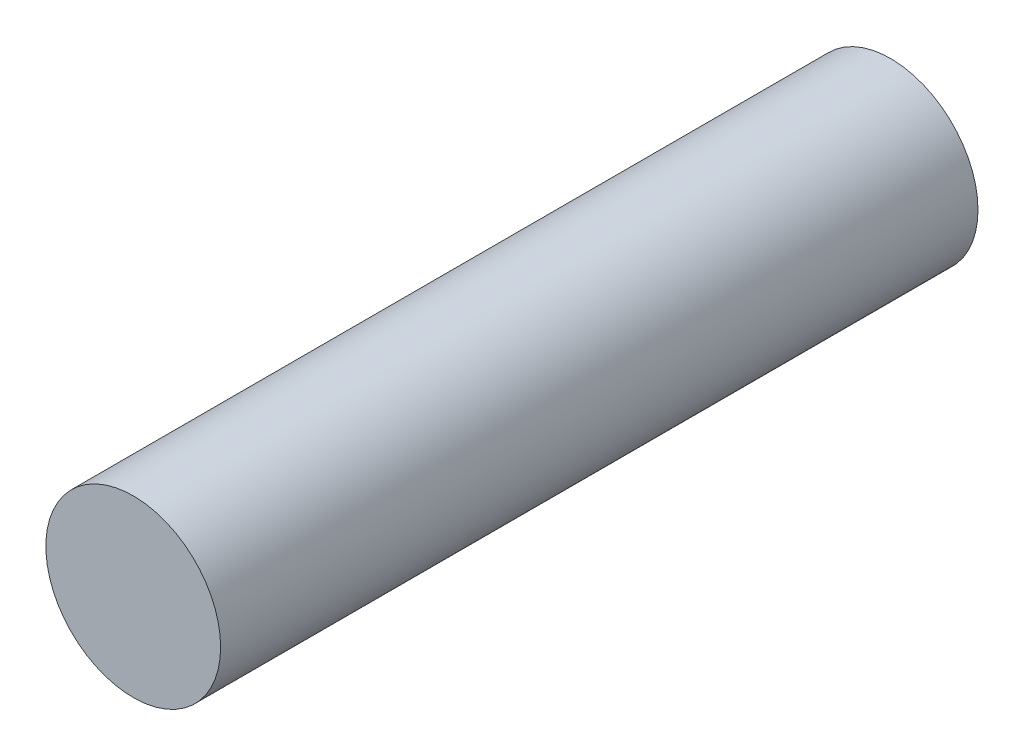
from build123d import *

# Parameters (mm, degrees)
SKETCH1_R           = 0.6477
BOSS_EXTRUDE1_DEPTH = 5.6134


with BuildPart() as part:
    # Sketch1 → Boss-Extrude1 (new body)
    with BuildSketch(Plane.XY):
        Circle(SKETCH1_R)
    extrude(amount=BOSS_EXTRUDE1_DEPTH)


solid = part.part
